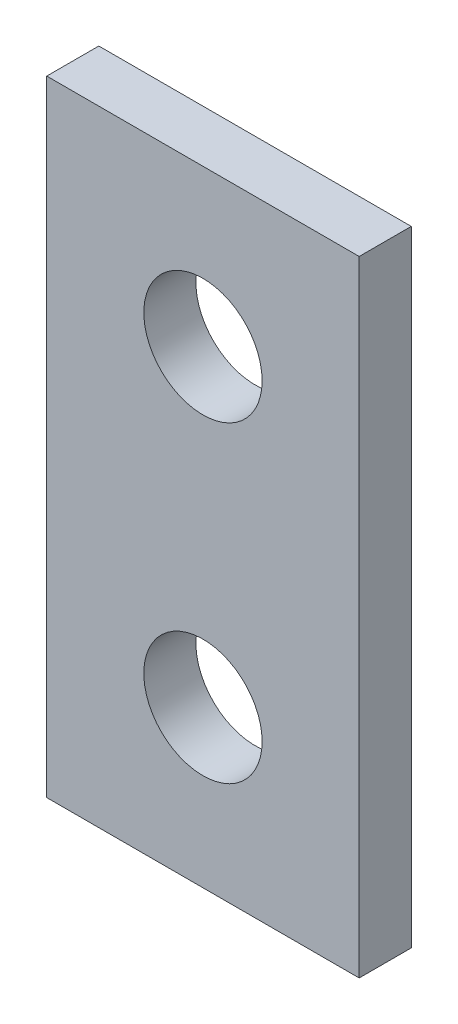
ISO-10303-21;
HEADER;
FILE_DESCRIPTION(('STEP AP214'),'2;1');
FILE_NAME('part.step','',(''),(''),'','','');
FILE_SCHEMA(('AUTOMOTIVE_DESIGN { 1 0 10303 214 1 1 1 1 }'));
ENDSEC;
DATA;
#1=APPLICATION_CONTEXT('core data for automotive mechanical design processes');
#2=APPLICATION_PROTOCOL_DEFINITION('international standard','automotive_design',2000,#1);
#3=PRODUCT_CONTEXT('',#1,'mechanical');
#4=PRODUCT('Part','Part','',(#3));
#5=PRODUCT_RELATED_PRODUCT_CATEGORY('part','',(#4));
#6=PRODUCT_DEFINITION_FORMATION('','',#4);
#7=PRODUCT_DEFINITION_CONTEXT('part definition',#1,'design');
#8=PRODUCT_DEFINITION('design','',#6,#7);
#9=PRODUCT_DEFINITION_SHAPE('','',#8);
#10=(LENGTH_UNIT() NAMED_UNIT(*) SI_UNIT(.MILLI.,.METRE.));
#11=(NAMED_UNIT(*) PLANE_ANGLE_UNIT() SI_UNIT($,.RADIAN.));
#12=(NAMED_UNIT(*) SI_UNIT($,.STERADIAN.) SOLID_ANGLE_UNIT());
#13=UNCERTAINTY_MEASURE_WITH_UNIT(LENGTH_MEASURE(1.E-05),#10,'distance_accuracy_value','');
#14=(GEOMETRIC_REPRESENTATION_CONTEXT(3) GLOBAL_UNCERTAINTY_ASSIGNED_CONTEXT((#13)) GLOBAL_UNIT_ASSIGNED_CONTEXT((#10,
#11,#12)) REPRESENTATION_CONTEXT('',''));
#15=CARTESIAN_POINT('',(0.,0.,0.));
#16=DIRECTION('',(0.,0.,1.));
#17=DIRECTION('',(1.,0.,0.));
#18=AXIS2_PLACEMENT_3D('',#15,#16,#17);
#19=CARTESIAN_POINT('',(4.7625,-9.525,-1.5875));
#20=DIRECTION('',(1.,0.,0.));
#21=DIRECTION('',(0.,0.,-1.));
#22=AXIS2_PLACEMENT_3D('',#19,#20,#21);
#23=PLANE('',#22);
#24=DIRECTION('',(0.,1.,0.));
#25=VECTOR('',#24,1.);
#26=CARTESIAN_POINT('',(4.7625,-9.525,0.));
#27=LINE('',#26,#25);
#28=CARTESIAN_POINT('',(4.7625,-9.525,0.));
#29=VERTEX_POINT('',#28);
#30=CARTESIAN_POINT('',(4.7625,9.525,0.));
#31=VERTEX_POINT('',#30);
#32=EDGE_CURVE('E100',#29,#31,#27,.T.);
#33=ORIENTED_EDGE('',*,*,#32,.F.);
#34=DIRECTION('',(0.,0.,1.));
#35=VECTOR('',#34,1.);
#36=CARTESIAN_POINT('',(4.7625,-9.525,-1.5875));
#37=LINE('',#36,#35);
#38=CARTESIAN_POINT('',(4.7625,-9.525,-1.5875));
#39=VERTEX_POINT('',#38);
#40=EDGE_CURVE('E11',#39,#29,#37,.T.);
#41=ORIENTED_EDGE('',*,*,#40,.F.);
#42=DIRECTION('',(0.,1.,0.));
#43=VECTOR('',#42,1.);
#44=CARTESIAN_POINT('',(4.7625,-9.525,-1.5875));
#45=LINE('',#44,#43);
#46=CARTESIAN_POINT('',(4.7625,9.525,-1.5875));
#47=VERTEX_POINT('',#46);
#48=EDGE_CURVE('E93',#39,#47,#45,.T.);
#49=ORIENTED_EDGE('',*,*,#48,.T.);
#50=DIRECTION('',(0.,0.,1.));
#51=VECTOR('',#50,1.);
#52=CARTESIAN_POINT('',(4.7625,9.525,-1.5875));
#53=LINE('',#52,#51);
#54=EDGE_CURVE('E38',#47,#31,#53,.T.);
#55=ORIENTED_EDGE('',*,*,#54,.T.);
#56=EDGE_LOOP('',(#33,#41,#49,#55));
#57=FACE_BOUND('',#56,.T.);
#58=ADVANCED_FACE('F35',(#57),#23,.T.);
#59=CARTESIAN_POINT('',(-4.7625,-9.525,-1.5875));
#60=DIRECTION('',(0.,-1.,0.));
#61=DIRECTION('',(0.,0.,-1.));
#62=AXIS2_PLACEMENT_3D('',#59,#60,#61);
#63=PLANE('',#62);
#64=DIRECTION('',(1.,0.,0.));
#65=VECTOR('',#64,1.);
#66=CARTESIAN_POINT('',(-4.7625,-9.525,0.));
#67=LINE('',#66,#65);
#68=CARTESIAN_POINT('',(-4.7625,-9.525,0.));
#69=VERTEX_POINT('',#68);
#70=EDGE_CURVE('E95',#69,#29,#67,.T.);
#71=ORIENTED_EDGE('',*,*,#70,.F.);
#72=DIRECTION('',(0.,0.,1.));
#73=VECTOR('',#72,1.);
#74=CARTESIAN_POINT('',(-4.7625,-9.525,-1.5875));
#75=LINE('',#74,#73);
#76=CARTESIAN_POINT('',(-4.7625,-9.525,-1.5875));
#77=VERTEX_POINT('',#76);
#78=EDGE_CURVE('E44',#77,#69,#75,.T.);
#79=ORIENTED_EDGE('',*,*,#78,.F.);
#80=DIRECTION('',(1.,0.,0.));
#81=VECTOR('',#80,1.);
#82=CARTESIAN_POINT('',(-4.7625,-9.525,-1.5875));
#83=LINE('',#82,#81);
#84=EDGE_CURVE('E90',#77,#39,#83,.T.);
#85=ORIENTED_EDGE('',*,*,#84,.T.);
#86=ORIENTED_EDGE('',*,*,#40,.T.);
#87=EDGE_LOOP('',(#71,#79,#85,#86));
#88=FACE_BOUND('',#87,.T.);
#89=ADVANCED_FACE('F111',(#88),#63,.T.);
#90=CARTESIAN_POINT('',(-4.7625,-9.525,-1.5875));
#91=DIRECTION('',(-1.,0.,0.));
#92=DIRECTION('',(0.,0.,1.));
#93=AXIS2_PLACEMENT_3D('',#90,#91,#92);
#94=PLANE('',#93);
#95=DIRECTION('',(0.,-1.,0.));
#96=VECTOR('',#95,1.);
#97=CARTESIAN_POINT('',(-4.7625,-9.525,0.));
#98=LINE('',#97,#96);
#99=CARTESIAN_POINT('',(-4.7625,9.525,0.));
#100=VERTEX_POINT('',#99);
#101=EDGE_CURVE('E85',#100,#69,#98,.T.);
#102=ORIENTED_EDGE('',*,*,#101,.F.);
#103=DIRECTION('',(0.,0.,1.));
#104=VECTOR('',#103,1.);
#105=CARTESIAN_POINT('',(-4.7625,9.525,-1.5875));
#106=LINE('',#105,#104);
#107=CARTESIAN_POINT('',(-4.7625,9.525,-1.5875));
#108=VERTEX_POINT('',#107);
#109=EDGE_CURVE('E80',#108,#100,#106,.T.);
#110=ORIENTED_EDGE('',*,*,#109,.F.);
#111=DIRECTION('',(0.,-1.,0.));
#112=VECTOR('',#111,1.);
#113=CARTESIAN_POINT('',(-4.7625,-9.525,-1.5875));
#114=LINE('',#113,#112);
#115=EDGE_CURVE('E83',#108,#77,#114,.T.);
#116=ORIENTED_EDGE('',*,*,#115,.T.);
#117=ORIENTED_EDGE('',*,*,#78,.T.);
#118=EDGE_LOOP('',(#102,#110,#116,#117));
#119=FACE_BOUND('',#118,.T.);
#120=ADVANCED_FACE('F82',(#119),#94,.T.);
#121=CARTESIAN_POINT('',(-4.7625,9.525,-1.5875));
#122=DIRECTION('',(0.,1.,0.));
#123=DIRECTION('',(0.,0.,1.));
#124=AXIS2_PLACEMENT_3D('',#121,#122,#123);
#125=PLANE('',#124);
#126=DIRECTION('',(-1.,0.,0.));
#127=VECTOR('',#126,1.);
#128=CARTESIAN_POINT('',(-4.7625,9.525,0.));
#129=LINE('',#128,#127);
#130=EDGE_CURVE('E103',#31,#100,#129,.T.);
#131=ORIENTED_EDGE('',*,*,#130,.F.);
#132=ORIENTED_EDGE('',*,*,#54,.F.);
#133=DIRECTION('',(-1.,0.,0.));
#134=VECTOR('',#133,1.);
#135=CARTESIAN_POINT('',(-4.7625,9.525,-1.5875));
#136=LINE('',#135,#134);
#137=EDGE_CURVE('E89',#47,#108,#136,.T.);
#138=ORIENTED_EDGE('',*,*,#137,.T.);
#139=ORIENTED_EDGE('',*,*,#109,.T.);
#140=EDGE_LOOP('',(#131,#132,#138,#139));
#141=FACE_BOUND('',#140,.T.);
#142=ADVANCED_FACE('F92',(#141),#125,.T.);
#143=CARTESIAN_POINT('',(0.,0.,-1.5875));
#144=DIRECTION('',(0.,0.,-1.));
#145=DIRECTION('',(-1.,0.,0.));
#146=AXIS2_PLACEMENT_3D('',#143,#144,#145);
#147=PLANE('',#146);
#148=CARTESIAN_POINT('',(0.,-4.7625,-1.5875));
#149=DIRECTION('',(0.,0.,1.));
#150=DIRECTION('',(1.,0.,0.));
#151=AXIS2_PLACEMENT_3D('',#148,#149,#150);
#152=CIRCLE('',#151,1.8034);
#153=CARTESIAN_POINT('',(1.8034,-4.7625,-1.5875));
#154=VERTEX_POINT('',#153);
#155=EDGE_CURVE('E144',#154,#154,#152,.T.);
#156=ORIENTED_EDGE('',*,*,#155,.T.);
#157=EDGE_LOOP('',(#156));
#158=FACE_BOUND('',#157,.T.);
#159=CARTESIAN_POINT('',(0.,4.7625,-1.5875));
#160=DIRECTION('',(0.,0.,1.));
#161=DIRECTION('',(1.,0.,0.));
#162=AXIS2_PLACEMENT_3D('',#159,#160,#161);
#163=CIRCLE('',#162,1.8034);
#164=CARTESIAN_POINT('',(1.8034,4.7625,-1.5875));
#165=VERTEX_POINT('',#164);
#166=EDGE_CURVE('E104',#165,#165,#163,.T.);
#167=ORIENTED_EDGE('',*,*,#166,.T.);
#168=EDGE_LOOP('',(#167));
#169=FACE_BOUND('',#168,.T.);
#170=ORIENTED_EDGE('',*,*,#48,.F.);
#171=ORIENTED_EDGE('',*,*,#84,.F.);
#172=ORIENTED_EDGE('',*,*,#115,.F.);
#173=ORIENTED_EDGE('',*,*,#137,.F.);
#174=EDGE_LOOP('',(#170,#171,#172,#173));
#175=FACE_BOUND('',#174,.T.);
#176=ADVANCED_FACE('F88',(#158,#169,#175),#147,.T.);
#177=CARTESIAN_POINT('',(0.,0.,0.));
#178=DIRECTION('',(0.,0.,-1.));
#179=DIRECTION('',(-1.,0.,0.));
#180=AXIS2_PLACEMENT_3D('',#177,#178,#179);
#181=PLANE('',#180);
#182=CARTESIAN_POINT('',(0.,-4.7625,0.));
#183=DIRECTION('',(0.,0.,1.));
#184=DIRECTION('',(1.,0.,0.));
#185=AXIS2_PLACEMENT_3D('',#182,#183,#184);
#186=CIRCLE('',#185,1.8034);
#187=CARTESIAN_POINT('',(1.8034,-4.7625,0.));
#188=VERTEX_POINT('',#187);
#189=EDGE_CURVE('E147',#188,#188,#186,.T.);
#190=ORIENTED_EDGE('',*,*,#189,.F.);
#191=EDGE_LOOP('',(#190));
#192=FACE_BOUND('',#191,.T.);
#193=CARTESIAN_POINT('',(0.,4.7625,0.));
#194=DIRECTION('',(0.,0.,1.));
#195=DIRECTION('',(1.,0.,0.));
#196=AXIS2_PLACEMENT_3D('',#193,#194,#195);
#197=CIRCLE('',#196,1.8034);
#198=CARTESIAN_POINT('',(1.8034,4.7625,0.));
#199=VERTEX_POINT('',#198);
#200=EDGE_CURVE('E149',#199,#199,#197,.T.);
#201=ORIENTED_EDGE('',*,*,#200,.F.);
#202=EDGE_LOOP('',(#201));
#203=FACE_BOUND('',#202,.T.);
#204=ORIENTED_EDGE('',*,*,#32,.T.);
#205=ORIENTED_EDGE('',*,*,#130,.T.);
#206=ORIENTED_EDGE('',*,*,#101,.T.);
#207=ORIENTED_EDGE('',*,*,#70,.T.);
#208=EDGE_LOOP('',(#204,#205,#206,#207));
#209=FACE_BOUND('',#208,.T.);
#210=ADVANCED_FACE('F110',(#192,#203,#209),#181,.F.);
#211=CARTESIAN_POINT('',(0.,4.7625,-1.5875));
#212=DIRECTION('',(0.,0.,1.));
#213=DIRECTION('',(1.,0.,0.));
#214=AXIS2_PLACEMENT_3D('',#211,#212,#213);
#215=CYLINDRICAL_SURFACE('',#214,1.8034);
#216=ORIENTED_EDGE('',*,*,#166,.F.);
#217=EDGE_LOOP('',(#216));
#218=FACE_BOUND('',#217,.T.);
#219=ORIENTED_EDGE('',*,*,#200,.T.);
#220=EDGE_LOOP('',(#219));
#221=FACE_BOUND('',#220,.T.);
#222=ADVANCED_FACE('F129',(#218,#221),#215,.F.);
#223=CARTESIAN_POINT('',(0.,-4.7625,-1.5875));
#224=DIRECTION('',(0.,0.,1.));
#225=DIRECTION('',(1.,0.,0.));
#226=AXIS2_PLACEMENT_3D('',#223,#224,#225);
#227=CYLINDRICAL_SURFACE('',#226,1.8034);
#228=ORIENTED_EDGE('',*,*,#155,.F.);
#229=EDGE_LOOP('',(#228));
#230=FACE_BOUND('',#229,.T.);
#231=ORIENTED_EDGE('',*,*,#189,.T.);
#232=EDGE_LOOP('',(#231));
#233=FACE_BOUND('',#232,.T.);
#234=ADVANCED_FACE('F136',(#230,#233),#227,.F.);
#235=CLOSED_SHELL('',(#58,#89,#120,#142,#176,#210,#222,#234));
#236=MANIFOLD_SOLID_BREP('B2',#235);
#237=ADVANCED_BREP_SHAPE_REPRESENTATION('',(#18,#236),#14);
#238=SHAPE_DEFINITION_REPRESENTATION(#9,#237);
ENDSEC;
END-ISO-10303-21;
